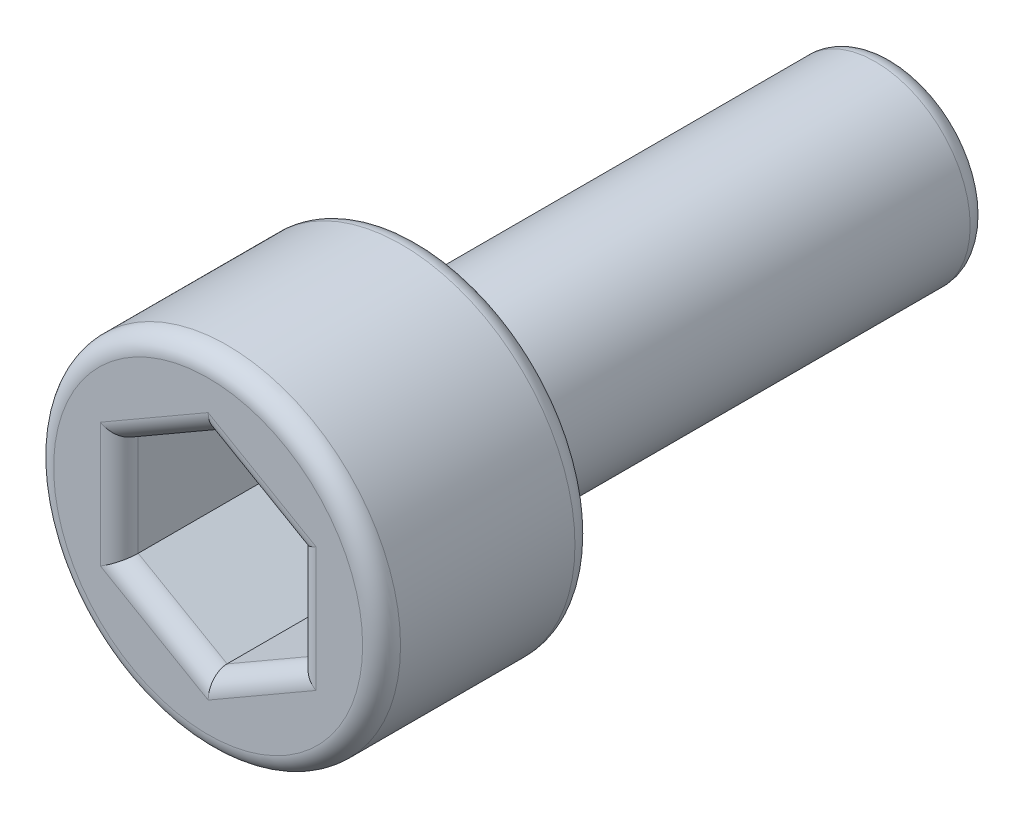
ISO-10303-21;
HEADER;
FILE_DESCRIPTION(('STEP AP214'),'2;1');
FILE_NAME('part.step','',(''),(''),'','','');
FILE_SCHEMA(('AUTOMOTIVE_DESIGN { 1 0 10303 214 1 1 1 1 }'));
ENDSEC;
DATA;
#1=APPLICATION_CONTEXT('core data for automotive mechanical design processes');
#2=APPLICATION_PROTOCOL_DEFINITION('international standard','automotive_design',2000,#1);
#3=PRODUCT_CONTEXT('',#1,'mechanical');
#4=PRODUCT('Part','Part','',(#3));
#5=PRODUCT_RELATED_PRODUCT_CATEGORY('part','',(#4));
#6=PRODUCT_DEFINITION_FORMATION('','',#4);
#7=PRODUCT_DEFINITION_CONTEXT('part definition',#1,'design');
#8=PRODUCT_DEFINITION('design','',#6,#7);
#9=PRODUCT_DEFINITION_SHAPE('','',#8);
#10=(LENGTH_UNIT() NAMED_UNIT(*) SI_UNIT(.MILLI.,.METRE.));
#11=(NAMED_UNIT(*) PLANE_ANGLE_UNIT() SI_UNIT($,.RADIAN.));
#12=(NAMED_UNIT(*) SI_UNIT($,.STERADIAN.) SOLID_ANGLE_UNIT());
#13=UNCERTAINTY_MEASURE_WITH_UNIT(LENGTH_MEASURE(1.E-05),#10,'distance_accuracy_value','');
#14=(GEOMETRIC_REPRESENTATION_CONTEXT(3) GLOBAL_UNCERTAINTY_ASSIGNED_CONTEXT((#13)) GLOBAL_UNIT_ASSIGNED_CONTEXT((#10,
#11,#12)) REPRESENTATION_CONTEXT('',''));
#15=CARTESIAN_POINT('',(0.,0.,0.));
#16=DIRECTION('',(0.,0.,1.));
#17=DIRECTION('',(1.,0.,0.));
#18=AXIS2_PLACEMENT_3D('',#15,#16,#17);
#19=CARTESIAN_POINT('',(0.,0.,6.35));
#20=DIRECTION('',(0.,0.,-1.));
#21=DIRECTION('',(-1.,0.,0.));
#22=AXIS2_PLACEMENT_3D('',#19,#20,#21);
#23=CYLINDRICAL_SURFACE('',#22,1.27);
#24=CARTESIAN_POINT('',(0.,0.,0.254));
#25=DIRECTION('',(0.,0.,1.));
#26=DIRECTION('',(1.,0.,0.));
#27=AXIS2_PLACEMENT_3D('',#24,#25,#26);
#28=CIRCLE('',#27,1.27);
#29=CARTESIAN_POINT('',(1.27,0.,0.254));
#30=VERTEX_POINT('',#29);
#31=EDGE_CURVE('E38',#30,#30,#28,.T.);
#32=ORIENTED_EDGE('',*,*,#31,.T.);
#33=EDGE_LOOP('',(#32));
#34=FACE_BOUND('',#33,.T.);
#35=CARTESIAN_POINT('',(0.,0.,6.35));
#36=DIRECTION('',(0.,0.,1.));
#37=DIRECTION('',(1.,0.,0.));
#38=AXIS2_PLACEMENT_3D('',#35,#36,#37);
#39=CIRCLE('',#38,1.27);
#40=CARTESIAN_POINT('',(1.27,0.,6.35));
#41=VERTEX_POINT('',#40);
#42=EDGE_CURVE('E144',#41,#41,#39,.T.);
#43=ORIENTED_EDGE('',*,*,#42,.F.);
#44=EDGE_LOOP('',(#43));
#45=FACE_BOUND('',#44,.T.);
#46=ADVANCED_FACE('F31',(#34,#45),#23,.T.);
#47=CARTESIAN_POINT('',(0.,0.,0.));
#48=DIRECTION('',(0.,0.,1.));
#49=DIRECTION('',(1.,0.,0.));
#50=AXIS2_PLACEMENT_3D('',#47,#48,#49);
#51=PLANE('',#50);
#52=CARTESIAN_POINT('',(0.,0.,0.));
#53=DIRECTION('',(0.,0.,1.));
#54=DIRECTION('',(1.,0.,0.));
#55=AXIS2_PLACEMENT_3D('',#52,#53,#54);
#56=CIRCLE('',#55,1.016);
#57=CARTESIAN_POINT('',(1.016,0.,0.));
#58=VERTEX_POINT('',#57);
#59=EDGE_CURVE('E11',#58,#58,#56,.F.);
#60=ORIENTED_EDGE('',*,*,#59,.T.);
#61=EDGE_LOOP('',(#60));
#62=FACE_BOUND('',#61,.T.);
#63=ADVANCED_FACE('F205',(#62),#51,.F.);
#64=CARTESIAN_POINT('',(0.,0.,6.35));
#65=DIRECTION('',(0.,0.,1.));
#66=DIRECTION('',(1.,0.,0.));
#67=AXIS2_PLACEMENT_3D('',#64,#65,#66);
#68=PLANE('',#67);
#69=CARTESIAN_POINT('',(0.,0.,6.35));
#70=DIRECTION('',(0.,0.,1.));
#71=DIRECTION('',(1.,0.,0.));
#72=AXIS2_PLACEMENT_3D('',#69,#70,#71);
#73=CIRCLE('',#72,2.0701);
#74=CARTESIAN_POINT('',(2.0701,0.,6.35));
#75=VERTEX_POINT('',#74);
#76=EDGE_CURVE('E182',#75,#75,#73,.F.);
#77=ORIENTED_EDGE('',*,*,#76,.T.);
#78=EDGE_LOOP('',(#77));
#79=FACE_BOUND('',#78,.T.);
#80=ORIENTED_EDGE('',*,*,#42,.T.);
#81=EDGE_LOOP('',(#80));
#82=FACE_BOUND('',#81,.T.);
#83=ADVANCED_FACE('F209',(#79,#82),#68,.F.);
#84=CARTESIAN_POINT('',(0.,0.,9.1948));
#85=DIRECTION('',(0.,0.,-1.));
#86=DIRECTION('',(-1.,0.,0.));
#87=AXIS2_PLACEMENT_3D('',#84,#85,#86);
#88=CYLINDRICAL_SURFACE('',#87,2.3241);
#89=CARTESIAN_POINT('',(0.,0.,6.604));
#90=DIRECTION('',(0.,0.,1.));
#91=DIRECTION('',(1.,0.,0.));
#92=AXIS2_PLACEMENT_3D('',#89,#90,#91);
#93=CIRCLE('',#92,2.3241);
#94=CARTESIAN_POINT('',(2.3241,0.,6.604));
#95=VERTEX_POINT('',#94);
#96=EDGE_CURVE('E179',#95,#95,#93,.T.);
#97=ORIENTED_EDGE('',*,*,#96,.T.);
#98=EDGE_LOOP('',(#97));
#99=FACE_BOUND('',#98,.T.);
#100=CARTESIAN_POINT('',(0.,0.,8.9408));
#101=DIRECTION('',(0.,0.,1.));
#102=DIRECTION('',(1.,0.,0.));
#103=AXIS2_PLACEMENT_3D('',#100,#101,#102);
#104=CIRCLE('',#103,2.3241);
#105=CARTESIAN_POINT('',(2.3241,0.,8.9408));
#106=VERTEX_POINT('',#105);
#107=EDGE_CURVE('E176',#106,#106,#104,.F.);
#108=ORIENTED_EDGE('',*,*,#107,.T.);
#109=EDGE_LOOP('',(#108));
#110=FACE_BOUND('',#109,.T.);
#111=ADVANCED_FACE('F214',(#99,#110),#88,.T.);
#112=CARTESIAN_POINT('',(0.,0.,9.1948));
#113=DIRECTION('',(0.,0.,1.));
#114=DIRECTION('',(1.,0.,0.));
#115=AXIS2_PLACEMENT_3D('',#112,#113,#114);
#116=PLANE('',#115);
#117=CARTESIAN_POINT('',(0.,0.,9.1948));
#118=DIRECTION('',(0.,0.,1.));
#119=DIRECTION('',(1.,0.,0.));
#120=AXIS2_PLACEMENT_3D('',#117,#118,#119);
#121=CIRCLE('',#120,2.0701);
#122=CARTESIAN_POINT('',(2.0701,0.,9.1948));
#123=VERTEX_POINT('',#122);
#124=EDGE_CURVE('E185',#123,#123,#121,.T.);
#125=ORIENTED_EDGE('',*,*,#124,.T.);
#126=EDGE_LOOP('',(#125));
#127=FACE_BOUND('',#126,.T.);
#128=DIRECTION('',(0.866025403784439,0.5,0.));
#129=VECTOR('',#128,1.);
#130=CARTESIAN_POINT('',(0.127,-1.59478578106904,9.1948));
#131=LINE('',#130,#129);
#132=CARTESIAN_POINT('',(1.444625,-0.834054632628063,9.1948));
#133=VERTEX_POINT('',#132);
#134=CARTESIAN_POINT('',(0.,-1.66810926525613,9.1948));
#135=VERTEX_POINT('',#134);
#136=EDGE_CURVE('E163',#133,#135,#131,.F.);
#137=ORIENTED_EDGE('',*,*,#136,.T.);
#138=DIRECTION('',(0.866025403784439,-0.5,0.));
#139=VECTOR('',#138,1.);
#140=CARTESIAN_POINT('',(-1.317625,-0.907378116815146,9.1948));
#141=LINE('',#140,#139);
#142=CARTESIAN_POINT('',(-1.444625,-0.834054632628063,9.1948));
#143=VERTEX_POINT('',#142);
#144=EDGE_CURVE('E165',#135,#143,#141,.F.);
#145=ORIENTED_EDGE('',*,*,#144,.T.);
#146=DIRECTION('',(0.,-1.,0.));
#147=VECTOR('',#146,1.);
#148=CARTESIAN_POINT('',(-1.444625,0.687407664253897,9.1948));
#149=LINE('',#148,#147);
#150=CARTESIAN_POINT('',(-1.444625,0.834054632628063,9.1948));
#151=VERTEX_POINT('',#150);
#152=EDGE_CURVE('E155',#143,#151,#149,.F.);
#153=ORIENTED_EDGE('',*,*,#152,.T.);
#154=DIRECTION('',(-0.866025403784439,-0.5,0.));
#155=VECTOR('',#154,1.);
#156=CARTESIAN_POINT('',(-0.127,1.59478578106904,9.1948));
#157=LINE('',#156,#155);
#158=CARTESIAN_POINT('',(0.,1.66810926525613,9.1948));
#159=VERTEX_POINT('',#158);
#160=EDGE_CURVE('E157',#151,#159,#157,.F.);
#161=ORIENTED_EDGE('',*,*,#160,.T.);
#162=DIRECTION('',(-0.866025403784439,0.5,0.));
#163=VECTOR('',#162,1.);
#164=CARTESIAN_POINT('',(1.317625,0.907378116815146,9.1948));
#165=LINE('',#164,#163);
#166=CARTESIAN_POINT('',(1.444625,0.834054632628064,9.1948));
#167=VERTEX_POINT('',#166);
#168=EDGE_CURVE('E159',#159,#167,#165,.F.);
#169=ORIENTED_EDGE('',*,*,#168,.T.);
#170=DIRECTION('',(0.,1.,0.));
#171=VECTOR('',#170,1.);
#172=CARTESIAN_POINT('',(1.444625,-0.687407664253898,9.1948));
#173=LINE('',#172,#171);
#174=EDGE_CURVE('E161',#167,#133,#173,.F.);
#175=ORIENTED_EDGE('',*,*,#174,.T.);
#176=EDGE_LOOP('',(#137,#145,#153,#161,#169,#175));
#177=FACE_BOUND('',#176,.T.);
#178=ADVANCED_FACE('F220',(#127,#177),#116,.T.);
#179=CARTESIAN_POINT('',(-1.190625,-0.687407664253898,7.1628));
#180=DIRECTION('',(-0.5,-0.866025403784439,0.));
#181=DIRECTION('',(0.866025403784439,-0.5,0.));
#182=AXIS2_PLACEMENT_3D('',#179,#180,#181);
#183=PLANE('',#182);
#184=DIRECTION('',(0.,0.,1.));
#185=VECTOR('',#184,1.);
#186=CARTESIAN_POINT('',(-1.190625,-0.687407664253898,7.1628));
#187=LINE('',#186,#185);
#188=CARTESIAN_POINT('',(-1.190625,-0.687407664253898,7.1628));
#189=VERTEX_POINT('',#188);
#190=CARTESIAN_POINT('',(-1.190625,-0.687407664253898,8.9408));
#191=VERTEX_POINT('',#190);
#192=EDGE_CURVE('E142',#189,#191,#187,.T.);
#193=ORIENTED_EDGE('',*,*,#192,.T.);
#194=DIRECTION('',(0.866025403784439,-0.5,0.));
#195=VECTOR('',#194,1.);
#196=CARTESIAN_POINT('',(0.,-1.3748153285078,8.9408));
#197=LINE('',#196,#195);
#198=CARTESIAN_POINT('',(0.,-1.3748153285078,8.9408));
#199=VERTEX_POINT('',#198);
#200=EDGE_CURVE('E111',#191,#199,#197,.T.);
#201=ORIENTED_EDGE('',*,*,#200,.T.);
#202=DIRECTION('',(0.,0.,1.));
#203=VECTOR('',#202,1.);
#204=CARTESIAN_POINT('',(0.,-1.3748153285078,7.1628));
#205=LINE('',#204,#203);
#206=CARTESIAN_POINT('',(0.,-1.3748153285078,7.1628));
#207=VERTEX_POINT('',#206);
#208=EDGE_CURVE('E103',#207,#199,#205,.T.);
#209=ORIENTED_EDGE('',*,*,#208,.F.);
#210=DIRECTION('',(0.866025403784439,-0.5,0.));
#211=VECTOR('',#210,1.);
#212=CARTESIAN_POINT('',(-1.190625,-0.687407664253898,7.1628));
#213=LINE('',#212,#211);
#214=EDGE_CURVE('E108',#189,#207,#213,.T.);
#215=ORIENTED_EDGE('',*,*,#214,.F.);
#216=EDGE_LOOP('',(#193,#201,#209,#215));
#217=FACE_BOUND('',#216,.T.);
#218=ADVANCED_FACE('F106',(#217),#183,.F.);
#219=CARTESIAN_POINT('',(-1.190625,0.687407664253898,7.1628));
#220=DIRECTION('',(-1.,0.,0.));
#221=DIRECTION('',(0.,-1.,0.));
#222=AXIS2_PLACEMENT_3D('',#219,#220,#221);
#223=PLANE('',#222);
#224=DIRECTION('',(0.,0.,1.));
#225=VECTOR('',#224,1.);
#226=CARTESIAN_POINT('',(-1.190625,0.687407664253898,7.1628));
#227=LINE('',#226,#225);
#228=CARTESIAN_POINT('',(-1.190625,0.687407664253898,7.1628));
#229=VERTEX_POINT('',#228);
#230=CARTESIAN_POINT('',(-1.190625,0.687407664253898,8.9408));
#231=VERTEX_POINT('',#230);
#232=EDGE_CURVE('E145',#229,#231,#227,.T.);
#233=ORIENTED_EDGE('',*,*,#232,.T.);
#234=DIRECTION('',(0.,-1.,0.));
#235=VECTOR('',#234,1.);
#236=CARTESIAN_POINT('',(-1.190625,-0.687407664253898,8.9408));
#237=LINE('',#236,#235);
#238=EDGE_CURVE('E174',#231,#191,#237,.T.);
#239=ORIENTED_EDGE('',*,*,#238,.T.);
#240=ORIENTED_EDGE('',*,*,#192,.F.);
#241=DIRECTION('',(0.,-1.,0.));
#242=VECTOR('',#241,1.);
#243=CARTESIAN_POINT('',(-1.190625,0.687407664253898,7.1628));
#244=LINE('',#243,#242);
#245=EDGE_CURVE('E114',#229,#189,#244,.T.);
#246=ORIENTED_EDGE('',*,*,#245,.F.);
#247=EDGE_LOOP('',(#233,#239,#240,#246));
#248=FACE_BOUND('',#247,.T.);
#249=ADVANCED_FACE('F227',(#248),#223,.F.);
#250=CARTESIAN_POINT('',(0.,1.3748153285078,7.1628));
#251=DIRECTION('',(-0.5,0.866025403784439,0.));
#252=DIRECTION('',(-0.866025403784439,-0.5,0.));
#253=AXIS2_PLACEMENT_3D('',#250,#251,#252);
#254=PLANE('',#253);
#255=DIRECTION('',(0.,0.,1.));
#256=VECTOR('',#255,1.);
#257=CARTESIAN_POINT('',(0.,1.3748153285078,7.1628));
#258=LINE('',#257,#256);
#259=CARTESIAN_POINT('',(0.,1.3748153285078,7.1628));
#260=VERTEX_POINT('',#259);
#261=CARTESIAN_POINT('',(0.,1.3748153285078,8.9408));
#262=VERTEX_POINT('',#261);
#263=EDGE_CURVE('E147',#260,#262,#258,.T.);
#264=ORIENTED_EDGE('',*,*,#263,.T.);
#265=DIRECTION('',(-0.866025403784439,-0.5,0.));
#266=VECTOR('',#265,1.);
#267=CARTESIAN_POINT('',(-1.190625,0.687407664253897,8.9408));
#268=LINE('',#267,#266);
#269=EDGE_CURVE('E45',#262,#231,#268,.T.);
#270=ORIENTED_EDGE('',*,*,#269,.T.);
#271=ORIENTED_EDGE('',*,*,#232,.F.);
#272=DIRECTION('',(-0.866025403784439,-0.5,0.));
#273=VECTOR('',#272,1.);
#274=CARTESIAN_POINT('',(0.,1.3748153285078,7.1628));
#275=LINE('',#274,#273);
#276=EDGE_CURVE('E139',#260,#229,#275,.T.);
#277=ORIENTED_EDGE('',*,*,#276,.F.);
#278=EDGE_LOOP('',(#264,#270,#271,#277));
#279=FACE_BOUND('',#278,.T.);
#280=ADVANCED_FACE('F237',(#279),#254,.F.);
#281=CARTESIAN_POINT('',(1.190625,0.687407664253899,7.1628));
#282=DIRECTION('',(0.5,0.866025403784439,0.));
#283=DIRECTION('',(-0.866025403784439,0.5,0.));
#284=AXIS2_PLACEMENT_3D('',#281,#282,#283);
#285=PLANE('',#284);
#286=DIRECTION('',(0.,0.,1.));
#287=VECTOR('',#286,1.);
#288=CARTESIAN_POINT('',(1.190625,0.687407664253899,7.1628));
#289=LINE('',#288,#287);
#290=CARTESIAN_POINT('',(1.190625,0.687407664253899,7.1628));
#291=VERTEX_POINT('',#290);
#292=CARTESIAN_POINT('',(1.190625,0.687407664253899,8.9408));
#293=VERTEX_POINT('',#292);
#294=EDGE_CURVE('E149',#291,#293,#289,.T.);
#295=ORIENTED_EDGE('',*,*,#294,.T.);
#296=DIRECTION('',(-0.866025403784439,0.5,0.));
#297=VECTOR('',#296,1.);
#298=CARTESIAN_POINT('',(0.,1.3748153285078,8.9408));
#299=LINE('',#298,#297);
#300=EDGE_CURVE('E53',#293,#262,#299,.T.);
#301=ORIENTED_EDGE('',*,*,#300,.T.);
#302=ORIENTED_EDGE('',*,*,#263,.F.);
#303=DIRECTION('',(-0.866025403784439,0.5,0.));
#304=VECTOR('',#303,1.);
#305=CARTESIAN_POINT('',(1.190625,0.687407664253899,7.1628));
#306=LINE('',#305,#304);
#307=EDGE_CURVE('E136',#291,#260,#306,.T.);
#308=ORIENTED_EDGE('',*,*,#307,.F.);
#309=EDGE_LOOP('',(#295,#301,#302,#308));
#310=FACE_BOUND('',#309,.T.);
#311=ADVANCED_FACE('F233',(#310),#285,.F.);
#312=CARTESIAN_POINT('',(1.190625,-0.687407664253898,7.1628));
#313=DIRECTION('',(1.,0.,0.));
#314=DIRECTION('',(0.,1.,0.));
#315=AXIS2_PLACEMENT_3D('',#312,#313,#314);
#316=PLANE('',#315);
#317=DIRECTION('',(0.,0.,1.));
#318=VECTOR('',#317,1.);
#319=CARTESIAN_POINT('',(1.190625,-0.687407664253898,7.1628));
#320=LINE('',#319,#318);
#321=CARTESIAN_POINT('',(1.190625,-0.687407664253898,7.1628));
#322=VERTEX_POINT('',#321);
#323=CARTESIAN_POINT('',(1.190625,-0.687407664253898,8.9408));
#324=VERTEX_POINT('',#323);
#325=EDGE_CURVE('E113',#322,#324,#320,.T.);
#326=ORIENTED_EDGE('',*,*,#325,.T.);
#327=DIRECTION('',(0.,1.,0.));
#328=VECTOR('',#327,1.);
#329=CARTESIAN_POINT('',(1.190625,0.687407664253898,8.9408));
#330=LINE('',#329,#328);
#331=EDGE_CURVE('E170',#324,#293,#330,.T.);
#332=ORIENTED_EDGE('',*,*,#331,.T.);
#333=ORIENTED_EDGE('',*,*,#294,.F.);
#334=DIRECTION('',(0.,1.,0.));
#335=VECTOR('',#334,1.);
#336=CARTESIAN_POINT('',(1.190625,-0.687407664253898,7.1628));
#337=LINE('',#336,#335);
#338=EDGE_CURVE('E123',#322,#291,#337,.T.);
#339=ORIENTED_EDGE('',*,*,#338,.F.);
#340=EDGE_LOOP('',(#326,#332,#333,#339));
#341=FACE_BOUND('',#340,.T.);
#342=ADVANCED_FACE('F230',(#341),#316,.F.);
#343=CARTESIAN_POINT('',(0.,-1.3748153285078,7.1628));
#344=DIRECTION('',(0.5,-0.866025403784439,0.));
#345=DIRECTION('',(0.866025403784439,0.5,0.));
#346=AXIS2_PLACEMENT_3D('',#343,#344,#345);
#347=PLANE('',#346);
#348=ORIENTED_EDGE('',*,*,#208,.T.);
#349=DIRECTION('',(0.866025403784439,0.5,0.));
#350=VECTOR('',#349,1.);
#351=CARTESIAN_POINT('',(1.190625,-0.687407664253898,8.9408));
#352=LINE('',#351,#350);
#353=EDGE_CURVE('E168',#199,#324,#352,.T.);
#354=ORIENTED_EDGE('',*,*,#353,.T.);
#355=ORIENTED_EDGE('',*,*,#325,.F.);
#356=DIRECTION('',(0.866025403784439,0.5,0.));
#357=VECTOR('',#356,1.);
#358=CARTESIAN_POINT('',(0.,-1.3748153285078,7.1628));
#359=LINE('',#358,#357);
#360=EDGE_CURVE('E117',#207,#322,#359,.T.);
#361=ORIENTED_EDGE('',*,*,#360,.F.);
#362=EDGE_LOOP('',(#348,#354,#355,#361));
#363=FACE_BOUND('',#362,.T.);
#364=ADVANCED_FACE('F118',(#363),#347,.F.);
#365=CARTESIAN_POINT('',(1.190625,-2.06222299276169,7.1628));
#366=DIRECTION('',(0.,0.,1.));
#367=DIRECTION('',(1.,0.,0.));
#368=AXIS2_PLACEMENT_3D('',#365,#366,#367);
#369=PLANE('',#368);
#370=ORIENTED_EDGE('',*,*,#214,.T.);
#371=ORIENTED_EDGE('',*,*,#360,.T.);
#372=ORIENTED_EDGE('',*,*,#338,.T.);
#373=ORIENTED_EDGE('',*,*,#307,.T.);
#374=ORIENTED_EDGE('',*,*,#276,.T.);
#375=ORIENTED_EDGE('',*,*,#245,.T.);
#376=EDGE_LOOP('',(#370,#371,#372,#373,#374,#375));
#377=FACE_BOUND('',#376,.T.);
#378=ADVANCED_FACE('F125',(#377),#369,.T.);
#379=CARTESIAN_POINT('',(1.317625,0.907378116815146,8.9408));
#380=DIRECTION('',(0.866025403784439,-0.5,0.));
#381=DIRECTION('',(0.5,0.866025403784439,0.));
#382=AXIS2_PLACEMENT_3D('',#379,#380,#381);
#383=CYLINDRICAL_SURFACE('',#382,0.254);
#384=CARTESIAN_POINT('',(1.444625,0.834054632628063,8.9408));
#385=DIRECTION('',(0.5,-0.866025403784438,0.));
#386=DIRECTION('',(-0.866025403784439,-0.5,0.));
#387=AXIS2_PLACEMENT_3D('',#384,#385,#386);
#388=ELLIPSE('',#387,0.29329393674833,0.254);
#389=EDGE_CURVE('E131',#167,#293,#388,.T.);
#390=ORIENTED_EDGE('',*,*,#389,.F.);
#391=ORIENTED_EDGE('',*,*,#168,.F.);
#392=CARTESIAN_POINT('',(0.,1.66810926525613,8.9408));
#393=DIRECTION('',(1.,0.,0.));
#394=DIRECTION('',(0.,-1.,0.));
#395=AXIS2_PLACEMENT_3D('',#392,#393,#394);
#396=ELLIPSE('',#395,0.29329393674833,0.254);
#397=EDGE_CURVE('E128',#262,#159,#396,.F.);
#398=ORIENTED_EDGE('',*,*,#397,.F.);
#399=ORIENTED_EDGE('',*,*,#300,.F.);
#400=EDGE_LOOP('',(#390,#391,#398,#399));
#401=FACE_BOUND('',#400,.T.);
#402=ADVANCED_FACE('F245',(#401),#383,.T.);
#403=CARTESIAN_POINT('',(-0.127,1.59478578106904,8.9408));
#404=DIRECTION('',(0.866025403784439,0.5,0.));
#405=DIRECTION('',(-0.5,0.866025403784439,0.));
#406=AXIS2_PLACEMENT_3D('',#403,#404,#405);
#407=CYLINDRICAL_SURFACE('',#406,0.254);
#408=ORIENTED_EDGE('',*,*,#397,.T.);
#409=ORIENTED_EDGE('',*,*,#160,.F.);
#410=CARTESIAN_POINT('',(-1.444625,0.834054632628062,8.9408));
#411=DIRECTION('',(0.5,0.866025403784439,0.));
#412=DIRECTION('',(0.866025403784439,-0.5,0.));
#413=AXIS2_PLACEMENT_3D('',#410,#411,#412);
#414=ELLIPSE('',#413,0.29329393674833,0.254);
#415=EDGE_CURVE('E297',#231,#151,#414,.F.);
#416=ORIENTED_EDGE('',*,*,#415,.F.);
#417=ORIENTED_EDGE('',*,*,#269,.F.);
#418=EDGE_LOOP('',(#408,#409,#416,#417));
#419=FACE_BOUND('',#418,.T.);
#420=ADVANCED_FACE('F248',(#419),#407,.T.);
#421=CARTESIAN_POINT('',(1.444625,-0.687407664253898,8.9408));
#422=DIRECTION('',(0.,-1.,0.));
#423=DIRECTION('',(1.,0.,0.));
#424=AXIS2_PLACEMENT_3D('',#421,#422,#423);
#425=CYLINDRICAL_SURFACE('',#424,0.254);
#426=ORIENTED_EDGE('',*,*,#389,.T.);
#427=ORIENTED_EDGE('',*,*,#331,.F.);
#428=CARTESIAN_POINT('',(1.444625,-0.834054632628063,8.9408));
#429=DIRECTION('',(-0.5,-0.866025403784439,0.));
#430=DIRECTION('',(-0.866025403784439,0.5,0.));
#431=AXIS2_PLACEMENT_3D('',#428,#429,#430);
#432=ELLIPSE('',#431,0.29329393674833,0.254);
#433=EDGE_CURVE('E293',#133,#324,#432,.T.);
#434=ORIENTED_EDGE('',*,*,#433,.F.);
#435=ORIENTED_EDGE('',*,*,#174,.F.);
#436=EDGE_LOOP('',(#426,#427,#434,#435));
#437=FACE_BOUND('',#436,.T.);
#438=ADVANCED_FACE('F252',(#437),#425,.T.);
#439=CARTESIAN_POINT('',(-1.444625,0.687407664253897,8.9408));
#440=DIRECTION('',(0.,1.,0.));
#441=DIRECTION('',(-1.,0.,0.));
#442=AXIS2_PLACEMENT_3D('',#439,#440,#441);
#443=CYLINDRICAL_SURFACE('',#442,0.254);
#444=ORIENTED_EDGE('',*,*,#415,.T.);
#445=ORIENTED_EDGE('',*,*,#152,.F.);
#446=CARTESIAN_POINT('',(-1.444625,-0.834054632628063,8.9408));
#447=DIRECTION('',(-0.5,0.866025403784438,0.));
#448=DIRECTION('',(-0.866025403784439,-0.5,0.));
#449=AXIS2_PLACEMENT_3D('',#446,#447,#448);
#450=ELLIPSE('',#449,0.29329393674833,0.254);
#451=EDGE_CURVE('E290',#191,#143,#450,.F.);
#452=ORIENTED_EDGE('',*,*,#451,.F.);
#453=ORIENTED_EDGE('',*,*,#238,.F.);
#454=EDGE_LOOP('',(#444,#445,#452,#453));
#455=FACE_BOUND('',#454,.T.);
#456=ADVANCED_FACE('F256',(#455),#443,.T.);
#457=CARTESIAN_POINT('',(0.127,-1.59478578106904,8.9408));
#458=DIRECTION('',(-0.866025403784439,-0.5,0.));
#459=DIRECTION('',(0.5,-0.866025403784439,0.));
#460=AXIS2_PLACEMENT_3D('',#457,#458,#459);
#461=CYLINDRICAL_SURFACE('',#460,0.254);
#462=ORIENTED_EDGE('',*,*,#433,.T.);
#463=ORIENTED_EDGE('',*,*,#353,.F.);
#464=CARTESIAN_POINT('',(0.,-1.66810926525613,8.9408));
#465=DIRECTION('',(-1.,0.,0.));
#466=DIRECTION('',(0.,1.,0.));
#467=AXIS2_PLACEMENT_3D('',#464,#465,#466);
#468=ELLIPSE('',#467,0.29329393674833,0.254);
#469=EDGE_CURVE('E287',#135,#199,#468,.T.);
#470=ORIENTED_EDGE('',*,*,#469,.F.);
#471=ORIENTED_EDGE('',*,*,#136,.F.);
#472=EDGE_LOOP('',(#462,#463,#470,#471));
#473=FACE_BOUND('',#472,.T.);
#474=ADVANCED_FACE('F260',(#473),#461,.T.);
#475=CARTESIAN_POINT('',(-1.317625,-0.907378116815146,8.9408));
#476=DIRECTION('',(-0.866025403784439,0.5,0.));
#477=DIRECTION('',(-0.5,-0.866025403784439,0.));
#478=AXIS2_PLACEMENT_3D('',#475,#476,#477);
#479=CYLINDRICAL_SURFACE('',#478,0.254);
#480=ORIENTED_EDGE('',*,*,#451,.T.);
#481=ORIENTED_EDGE('',*,*,#144,.F.);
#482=ORIENTED_EDGE('',*,*,#469,.T.);
#483=ORIENTED_EDGE('',*,*,#200,.F.);
#484=EDGE_LOOP('',(#480,#481,#482,#483));
#485=FACE_BOUND('',#484,.T.);
#486=ADVANCED_FACE('F264',(#485),#479,.T.);
#487=CARTESIAN_POINT('',(0.,0.,6.604));
#488=DIRECTION('',(0.,0.,1.));
#489=DIRECTION('',(1.,0.,0.));
#490=AXIS2_PLACEMENT_3D('',#487,#488,#489);
#491=TOROIDAL_SURFACE('',#490,2.0701,0.254);
#492=ORIENTED_EDGE('',*,*,#76,.F.);
#493=EDGE_LOOP('',(#492));
#494=FACE_BOUND('',#493,.T.);
#495=ORIENTED_EDGE('',*,*,#96,.F.);
#496=EDGE_LOOP('',(#495));
#497=FACE_BOUND('',#496,.T.);
#498=ADVANCED_FACE('F200',(#494,#497),#491,.T.);
#499=CARTESIAN_POINT('',(0.,0.,8.9408));
#500=DIRECTION('',(0.,0.,1.));
#501=DIRECTION('',(1.,0.,0.));
#502=AXIS2_PLACEMENT_3D('',#499,#500,#501);
#503=TOROIDAL_SURFACE('',#502,2.0701,0.254);
#504=ORIENTED_EDGE('',*,*,#107,.F.);
#505=EDGE_LOOP('',(#504));
#506=FACE_BOUND('',#505,.T.);
#507=ORIENTED_EDGE('',*,*,#124,.F.);
#508=EDGE_LOOP('',(#507));
#509=FACE_BOUND('',#508,.T.);
#510=ADVANCED_FACE('F194',(#506,#509),#503,.T.);
#511=CARTESIAN_POINT('',(0.,0.,0.254));
#512=DIRECTION('',(0.,0.,1.));
#513=DIRECTION('',(1.,0.,0.));
#514=AXIS2_PLACEMENT_3D('',#511,#512,#513);
#515=TOROIDAL_SURFACE('',#514,1.016,0.254);
#516=ORIENTED_EDGE('',*,*,#59,.F.);
#517=EDGE_LOOP('',(#516));
#518=FACE_BOUND('',#517,.T.);
#519=ORIENTED_EDGE('',*,*,#31,.F.);
#520=EDGE_LOOP('',(#519));
#521=FACE_BOUND('',#520,.T.);
#522=ADVANCED_FACE('F192',(#518,#521),#515,.T.);
#523=CLOSED_SHELL('',(#46,#63,#83,#111,#178,#218,#249,#280,#311,#342,#364,#378,#402,#420,#438,
#456,#474,#486,#498,#510,#522));
#524=MANIFOLD_SOLID_BREP('B2',#523);
#525=ADVANCED_BREP_SHAPE_REPRESENTATION('',(#18,#524),#14);
#526=SHAPE_DEFINITION_REPRESENTATION(#9,#525);
ENDSEC;
END-ISO-10303-21;
